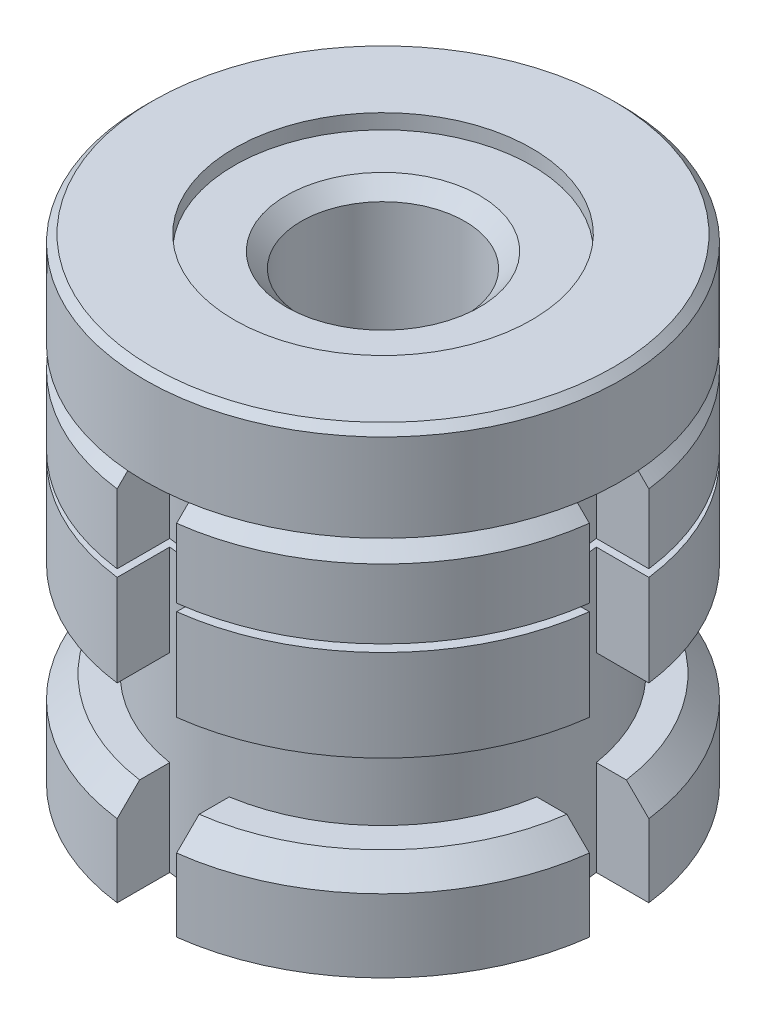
from build123d import *
from build123d.topology import SkipClean

# Parameters (mm, degrees)
SKETCH1_R           = 16
BOSS_EXTRUDE1_DEPTH = 12.8
SKETCH2_W           = 6
SKETCH2_H           = 0.5
SKETCH3_R           = 12.5
BOSS_EXTRUDE2_DEPTH = 12.8
SKETCH4_R           = 16
BOSS_EXTRUDE3_DEPTH = 6.4
CUT_EXTRUDE4_START  = -25.6
CUT_EXTRUDE4_DEPTH  = 25.6
CHAMFER1_SIZE       = 1.5
SKETCH6_R           = 16
BOSS_EXTRUDE4_DEPTH = 6.4
CHAMFER2_SIZE       = 0.5
CUT_EXTRUDE5_START  = -1
SKETCH7_R           = 10
CUT_EXTRUDE5_DEPTH  = 1
SKETCH8_R           = 5.5
CUT_EXTRUDE6_DEPTH  = 31
CHAMFER3_SIZE       = 1


with BuildPart() as part:
    # Sketch1 → Boss-Extrude1 (new body)
    with BuildSketch(Plane(origin=(0, 0, 0), x_dir=(1, 0, 0), z_dir=(0, 1, 0))):
        with Locations(Location((0, 0, 0), (0, 0, 270))):
            Circle(SKETCH1_R)
    extrude(amount=BOSS_EXTRUDE1_DEPTH)

    # Sketch2 → Cut-Revolve1 (revolve, cut)
    with BuildSketch(Plane(origin=(0, 0, 0), x_dir=(0, 0, -1), z_dir=(1, 0, 0))):
        with Locations((-13, 6.4)):
            Rectangle(SKETCH2_W, SKETCH2_H)
    revolve(axis=Axis((0, 13.26477, 0), (0, -1, 0)), mode=Mode.SUBTRACT)

    # Sketch3 → Boss-Extrude2 (add)
    with BuildSketch(Plane.XZ):
        with Locations(Location((0, 0, 0), (0, 0, 270))):
            Circle(SKETCH3_R)
    extrude(amount=BOSS_EXTRUDE2_DEPTH)

    # Sketch4 → Boss-Extrude3 (add)
    with BuildSketch(Plane.XZ.offset(12.8)):
        with Locations(Location((0, 0, 0), (0, 0, 90))):
            Circle(SKETCH4_R)
    extrude(amount=-BOSS_EXTRUDE3_DEPTH)

    # Sketch5 → Cut-Extrude4 (cut)
    with SkipClean():  # the faces are left unmerged after this step: merging them gives an invalid solid
        with BuildSketch(Plane(origin=(0, 12.8, 0), x_dir=(1, 0, 0), z_dir=(0, 1, 0)).offset(CUT_EXTRUDE4_START)):
            with BuildLine():
                Line((-15.874508, 2), (-12.338963, 2))
                ThreePointArc((-12.338963, 2), (-12.5, 0), (-12.338963, -2))
                Line((-12.338963, -2), (-15.874508, -2))
                ThreePointArc((-15.874508, -2), (-16, 0), (-15.874508, 2))
            make_face()
            with BuildLine():
                Line((-2, 15.874508), (-2, 12.338963))
                ThreePointArc((-2, 12.338963), (0, 12.5), (2, 12.338963))
                Line((2, 12.338963), (2, 15.874508))
                ThreePointArc((2, 15.874508), (0, 16), (-2, 15.874508))
            make_face()
            with BuildLine():
                Line((12.338963, 2), (15.874508, 2))
                ThreePointArc((15.874508, 2), (16, 0), (15.874508, -2))
                Line((15.874508, -2), (12.338963, -2))
                ThreePointArc((12.338963, -2), (12.5, 0), (12.338963, 2))
            make_face()
            with BuildLine():
                Line((-2, -12.338963), (-2, -15.874508))
                ThreePointArc((-2, -15.874508), (0, -16), (2, -15.874508))
                Line((2, -15.874508), (2, -12.338963))
                ThreePointArc((2, -12.338963), (0, -12.5), (-2, -12.338963))
            make_face()
        extrude(amount=CUT_EXTRUDE4_DEPTH, mode=Mode.SUBTRACT)

    # Chamfer1
    chamfer1_edges = [part.edges().sort_by_distance(p)[0] for p in [
        (11.313708, -6.4, -11.313708),
        (11.313708, -6.4, 11.313708),
        (-11.313708, -6.4, 11.313708),
        (-11.313708, -6.4, -11.313708),
        (11.313708, 12.8, 11.313708),
        (11.313708, 12.8, -11.313708),
        (-11.313708, 12.8, -11.313708),
        (-11.313708, 12.8, 11.313708),
    ]]
    chamfer(chamfer1_edges, length=CHAMFER1_SIZE)

    # Sketch6 → Boss-Extrude4 (add)
    with BuildSketch(Plane(origin=(0, 12.8, 0), x_dir=(1, 0, 0), z_dir=(0, 1, 0))):
        with Locations(Location((0, 0, 0), (0, 0, 270))):
            Circle(SKETCH6_R)
    extrude(amount=BOSS_EXTRUDE4_DEPTH)

    # Chamfer2
    chamfer2_edges = [part.edges().sort_by_distance(p)[0] for p in [
        (0, 19.2, -16),
    ]]
    chamfer(chamfer2_edges, length=CHAMFER2_SIZE)

    # Sketch7 → Cut-Extrude5 (cut)
    with BuildSketch(Plane(origin=(0, 19.2, 0), x_dir=(1, 0, 0), z_dir=(0, 1, 0)).offset(CUT_EXTRUDE5_START)):
        with Locations(Location((0, 0, 0), (0, 0, 270))):
            Circle(SKETCH7_R)
    extrude(amount=CUT_EXTRUDE5_DEPTH, mode=Mode.SUBTRACT)

    # Sketch8 → Cut-Extrude6 (cut)
    with BuildSketch(Plane(origin=(0, 18.2, 0), x_dir=(1, 0, 0), z_dir=(0, 1, 0))):
        with Locations(Location((0, 0, 0), (0, 0, 270))):
            Circle(SKETCH8_R)
    extrude(amount=-CUT_EXTRUDE6_DEPTH, mode=Mode.SUBTRACT)

    # Chamfer3
    chamfer3_edges = [part.edges().sort_by_distance(p)[0] for p in [
        (0, 18.2, -5.5),
        (0, -12.8, -5.5),
    ]]
    chamfer(chamfer3_edges, length=CHAMFER3_SIZE)


solid = part.part
